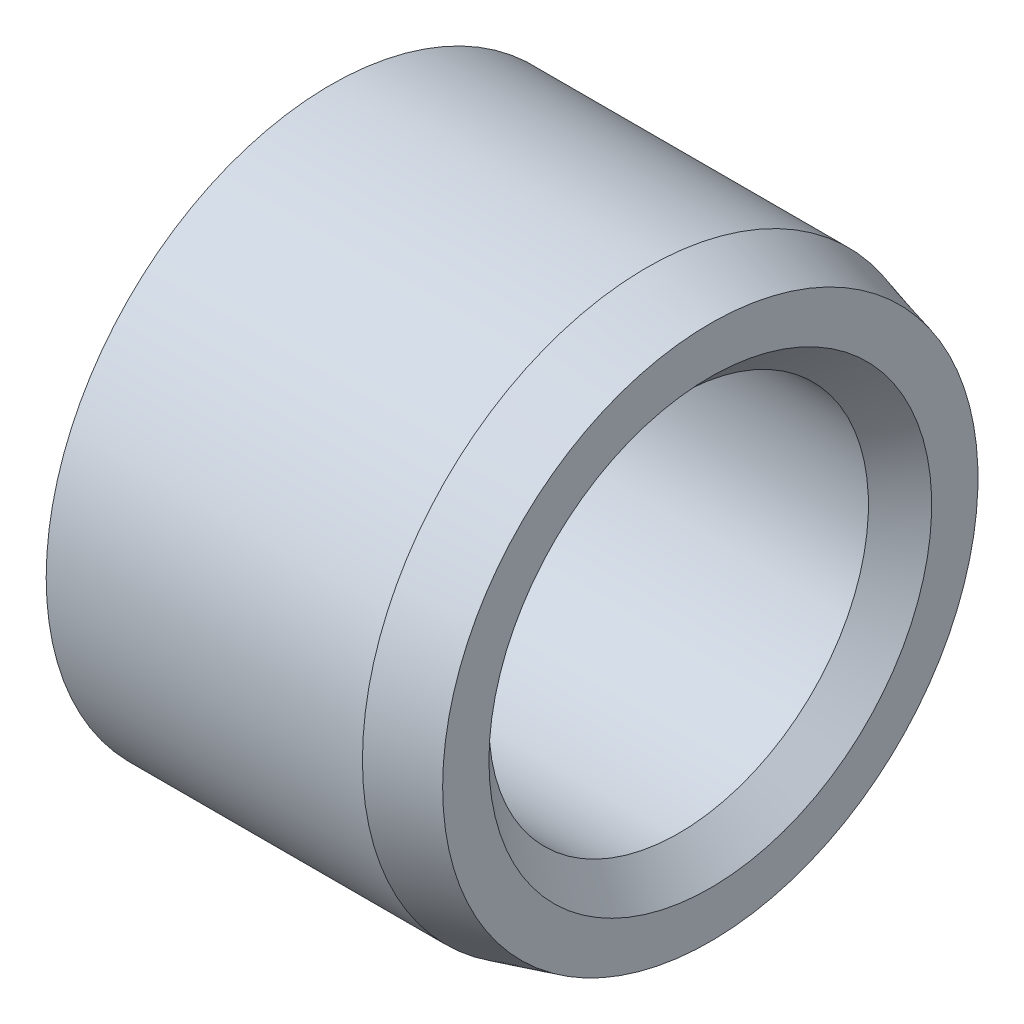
ISO-10303-21;
HEADER;
FILE_DESCRIPTION(('STEP AP214'),'2;1');
FILE_NAME('part.step','',(''),(''),'','','');
FILE_SCHEMA(('AUTOMOTIVE_DESIGN { 1 0 10303 214 1 1 1 1 }'));
ENDSEC;
DATA;
#1=APPLICATION_CONTEXT('core data for automotive mechanical design processes');
#2=APPLICATION_PROTOCOL_DEFINITION('international standard','automotive_design',2000,#1);
#3=PRODUCT_CONTEXT('',#1,'mechanical');
#4=PRODUCT('Part','Part','',(#3));
#5=PRODUCT_RELATED_PRODUCT_CATEGORY('part','',(#4));
#6=PRODUCT_DEFINITION_FORMATION('','',#4);
#7=PRODUCT_DEFINITION_CONTEXT('part definition',#1,'design');
#8=PRODUCT_DEFINITION('design','',#6,#7);
#9=PRODUCT_DEFINITION_SHAPE('','',#8);
#10=(LENGTH_UNIT() NAMED_UNIT(*) SI_UNIT(.MILLI.,.METRE.));
#11=(NAMED_UNIT(*) PLANE_ANGLE_UNIT() SI_UNIT($,.RADIAN.));
#12=(NAMED_UNIT(*) SI_UNIT($,.STERADIAN.) SOLID_ANGLE_UNIT());
#13=UNCERTAINTY_MEASURE_WITH_UNIT(LENGTH_MEASURE(1.E-05),#10,'distance_accuracy_value','');
#14=(GEOMETRIC_REPRESENTATION_CONTEXT(3) GLOBAL_UNCERTAINTY_ASSIGNED_CONTEXT((#13)) GLOBAL_UNIT_ASSIGNED_CONTEXT((#10,
#11,#12)) REPRESENTATION_CONTEXT('',''));
#15=CARTESIAN_POINT('',(0.,0.,0.));
#16=DIRECTION('',(0.,0.,1.));
#17=DIRECTION('',(1.,0.,0.));
#18=AXIS2_PLACEMENT_3D('',#15,#16,#17);
#19=CARTESIAN_POINT('',(2.49999999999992,0.,0.));
#20=DIRECTION('',(-1.,0.,0.));
#21=DIRECTION('',(0.,0.,1.));
#22=AXIS2_PLACEMENT_3D('',#19,#20,#21);
#23=CONICAL_SURFACE('',#22,2.25,0.261799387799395);
#24=CARTESIAN_POINT('',(3.,0.,0.));
#25=DIRECTION('',(-1.,0.,0.));
#26=DIRECTION('',(0.,0.,1.));
#27=AXIS2_PLACEMENT_3D('',#24,#25,#26);
#28=CIRCLE('',#27,2.11602540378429);
#29=CARTESIAN_POINT('',(3.,0.,2.11602540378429));
#30=VERTEX_POINT('',#29);
#31=EDGE_CURVE('E10',#30,#30,#28,.T.);
#32=ORIENTED_EDGE('',*,*,#31,.T.);
#33=EDGE_LOOP('',(#32));
#34=FACE_BOUND('',#33,.T.);
#35=CARTESIAN_POINT('',(2.49999999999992,0.,0.));
#36=DIRECTION('',(-1.,0.,0.));
#37=DIRECTION('',(0.,0.,1.));
#38=AXIS2_PLACEMENT_3D('',#35,#36,#37);
#39=CIRCLE('',#38,2.25);
#40=CARTESIAN_POINT('',(2.49999999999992,0.,2.25));
#41=VERTEX_POINT('',#40);
#42=EDGE_CURVE('E54',#41,#41,#39,.T.);
#43=ORIENTED_EDGE('',*,*,#42,.F.);
#44=EDGE_LOOP('',(#43));
#45=FACE_BOUND('',#44,.T.);
#46=ADVANCED_FACE('F29',(#34,#45),#23,.T.);
#47=CARTESIAN_POINT('',(3.,2.11602540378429,0.));
#48=DIRECTION('',(1.,0.,0.));
#49=DIRECTION('',(0.,0.,-1.));
#50=AXIS2_PLACEMENT_3D('',#47,#48,#49);
#51=PLANE('',#50);
#52=CARTESIAN_POINT('',(3.,0.,0.));
#53=DIRECTION('',(-1.,0.,0.));
#54=DIRECTION('',(0.,0.,1.));
#55=AXIS2_PLACEMENT_3D('',#52,#53,#54);
#56=CIRCLE('',#55,1.75);
#57=CARTESIAN_POINT('',(3.,0.,1.75));
#58=VERTEX_POINT('',#57);
#59=EDGE_CURVE('E35',#58,#58,#56,.T.);
#60=ORIENTED_EDGE('',*,*,#59,.T.);
#61=EDGE_LOOP('',(#60));
#62=FACE_BOUND('',#61,.T.);
#63=ORIENTED_EDGE('',*,*,#31,.F.);
#64=EDGE_LOOP('',(#63));
#65=FACE_BOUND('',#64,.T.);
#66=ADVANCED_FACE('F62',(#62,#65),#51,.T.);
#67=CARTESIAN_POINT('',(3.,0.,0.));
#68=DIRECTION('',(1.,0.,0.));
#69=DIRECTION('',(0.,0.,-1.));
#70=AXIS2_PLACEMENT_3D('',#67,#68,#69);
#71=CONICAL_SURFACE('',#70,1.75,0.785398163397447);
#72=CARTESIAN_POINT('',(2.75,0.,0.));
#73=DIRECTION('',(-1.,0.,0.));
#74=DIRECTION('',(0.,0.,1.));
#75=AXIS2_PLACEMENT_3D('',#72,#73,#74);
#76=CIRCLE('',#75,1.5);
#77=CARTESIAN_POINT('',(2.75,0.,1.5));
#78=VERTEX_POINT('',#77);
#79=EDGE_CURVE('E39',#78,#78,#76,.T.);
#80=ORIENTED_EDGE('',*,*,#79,.T.);
#81=EDGE_LOOP('',(#80));
#82=FACE_BOUND('',#81,.T.);
#83=ORIENTED_EDGE('',*,*,#59,.F.);
#84=EDGE_LOOP('',(#83));
#85=FACE_BOUND('',#84,.T.);
#86=ADVANCED_FACE('F66',(#82,#85),#71,.F.);
#87=CARTESIAN_POINT('',(3.00000000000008,0.,0.));
#88=DIRECTION('',(-1.,0.,0.));
#89=DIRECTION('',(0.,0.,1.));
#90=AXIS2_PLACEMENT_3D('',#87,#88,#89);
#91=CYLINDRICAL_SURFACE('',#90,1.5);
#92=CARTESIAN_POINT('',(0.3,0.,0.));
#93=DIRECTION('',(-1.,0.,0.));
#94=DIRECTION('',(0.,0.,1.));
#95=AXIS2_PLACEMENT_3D('',#92,#93,#94);
#96=CIRCLE('',#95,1.5);
#97=CARTESIAN_POINT('',(0.3,0.,1.5));
#98=VERTEX_POINT('',#97);
#99=EDGE_CURVE('E43',#98,#98,#96,.T.);
#100=ORIENTED_EDGE('',*,*,#99,.T.);
#101=EDGE_LOOP('',(#100));
#102=FACE_BOUND('',#101,.T.);
#103=ORIENTED_EDGE('',*,*,#79,.F.);
#104=EDGE_LOOP('',(#103));
#105=FACE_BOUND('',#104,.T.);
#106=ADVANCED_FACE('F70',(#102,#105),#91,.F.);
#107=CARTESIAN_POINT('',(0.3,0.,0.));
#108=DIRECTION('',(-1.,0.,0.));
#109=DIRECTION('',(0.,0.,1.));
#110=AXIS2_PLACEMENT_3D('',#107,#108,#109);
#111=CONICAL_SURFACE('',#110,1.5,0.785398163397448);
#112=CARTESIAN_POINT('',(0.,0.,0.));
#113=DIRECTION('',(-1.,0.,0.));
#114=DIRECTION('',(0.,0.,1.));
#115=AXIS2_PLACEMENT_3D('',#112,#113,#114);
#116=CIRCLE('',#115,1.8);
#117=CARTESIAN_POINT('',(0.,0.,1.8));
#118=VERTEX_POINT('',#117);
#119=EDGE_CURVE('E48',#118,#118,#116,.T.);
#120=ORIENTED_EDGE('',*,*,#119,.T.);
#121=EDGE_LOOP('',(#120));
#122=FACE_BOUND('',#121,.T.);
#123=ORIENTED_EDGE('',*,*,#99,.F.);
#124=EDGE_LOOP('',(#123));
#125=FACE_BOUND('',#124,.T.);
#126=ADVANCED_FACE('F77',(#122,#125),#111,.F.);
#127=CARTESIAN_POINT('',(0.,1.8,0.));
#128=DIRECTION('',(-1.,0.,0.));
#129=DIRECTION('',(0.,0.,1.));
#130=AXIS2_PLACEMENT_3D('',#127,#128,#129);
#131=PLANE('',#130);
#132=CARTESIAN_POINT('',(0.,0.,0.));
#133=DIRECTION('',(-1.,0.,0.));
#134=DIRECTION('',(0.,0.,1.));
#135=AXIS2_PLACEMENT_3D('',#132,#133,#134);
#136=CIRCLE('',#135,2.25);
#137=CARTESIAN_POINT('',(0.,0.,2.25));
#138=VERTEX_POINT('',#137);
#139=EDGE_CURVE('E51',#138,#138,#136,.T.);
#140=ORIENTED_EDGE('',*,*,#139,.T.);
#141=EDGE_LOOP('',(#140));
#142=FACE_BOUND('',#141,.T.);
#143=ORIENTED_EDGE('',*,*,#119,.F.);
#144=EDGE_LOOP('',(#143));
#145=FACE_BOUND('',#144,.T.);
#146=ADVANCED_FACE('F81',(#142,#145),#131,.T.);
#147=CARTESIAN_POINT('',(3.00000000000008,0.,0.));
#148=DIRECTION('',(-1.,0.,0.));
#149=DIRECTION('',(0.,0.,1.));
#150=AXIS2_PLACEMENT_3D('',#147,#148,#149);
#151=CYLINDRICAL_SURFACE('',#150,2.25);
#152=ORIENTED_EDGE('',*,*,#42,.T.);
#153=EDGE_LOOP('',(#152));
#154=FACE_BOUND('',#153,.T.);
#155=ORIENTED_EDGE('',*,*,#139,.F.);
#156=EDGE_LOOP('',(#155));
#157=FACE_BOUND('',#156,.T.);
#158=ADVANCED_FACE('F58',(#154,#157),#151,.T.);
#159=CLOSED_SHELL('',(#46,#66,#86,#106,#126,#146,#158));
#160=MANIFOLD_SOLID_BREP('B2',#159);
#161=ADVANCED_BREP_SHAPE_REPRESENTATION('',(#18,#160),#14);
#162=SHAPE_DEFINITION_REPRESENTATION(#9,#161);
ENDSEC;
END-ISO-10303-21;
